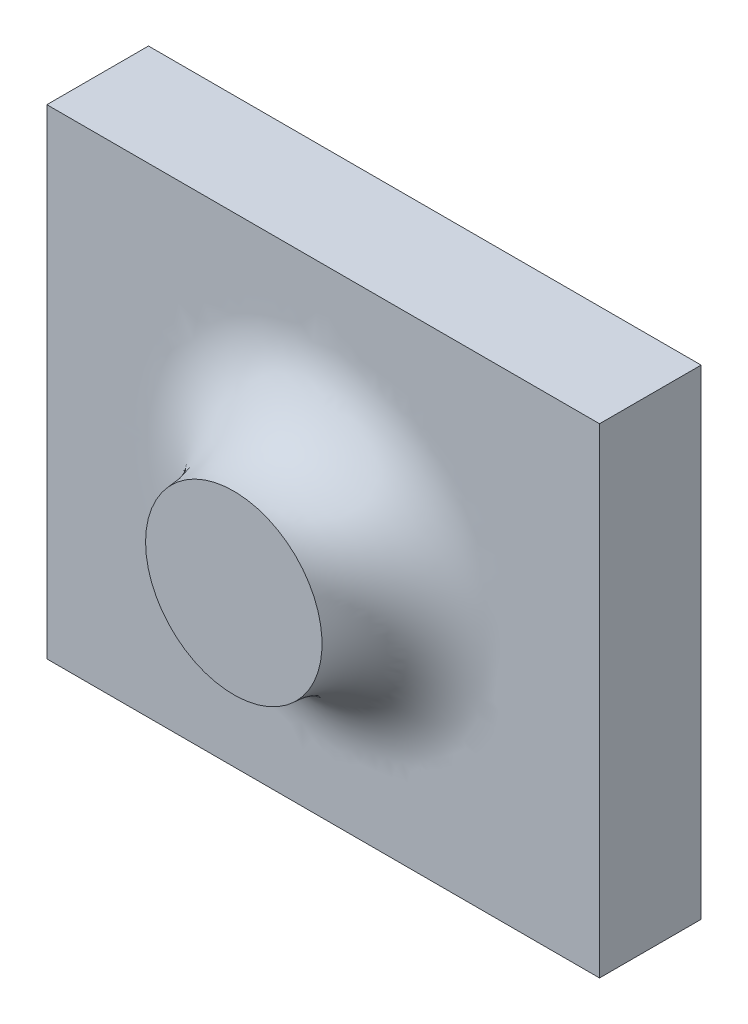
from build123d import *

# Parameters (mm, degrees)
SKIZZE1_W               = 130.20945863
SKIZZE1_H               = 113.09270106
LINEAR_AUSTRAGEN1_DEPTH = 45


with BuildPart() as part:
    # Skizze1 → Linear austragen1 (new body)
    with BuildSketch(Plane.XY):
        Rectangle(SKIZZE1_W, SKIZZE1_H)
    extrude(amount=-LINEAR_AUSTRAGEN1_DEPTH)

    # Skizze2 → Schnitt-Rotation1 (revolve, cut)
    with BuildSketch(Plane(origin=(0, 0, 0), x_dir=(1, 0, 0), z_dir=(0, 1, 0))):
        with BuildLine():
            Line((-127.959669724, 21.063539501), (-127.959669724, 0))
            Line((-127.959669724, 0), (-20.787669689, 0))
            add(Edge.make_bspline(
                [(-20.787669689, 0), (-20.787669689, 11.815073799), (-28.912831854, 20.392818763), (-40.710569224, 21.032632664), (-40.837167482, 21.03949833), (-41.090487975, 21.050943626), (-41.470856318, 21.063539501), (-41.7244249, 21.063539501), (-41.85120919, 21.063539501), (-41.977195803, 21.063539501), (-42.229169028, 21.063539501), (-42.607128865, 21.063539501), (-42.85910209, 21.063539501), (-42.985088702, 21.063539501), (-71.309949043, 21.063539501), (-99.634809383, 21.063539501), (-127.959669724, 21.063539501)],
                knots=[0, 0, 0, 0, 0.249273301, 0.249273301, 0.249273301, 0.252545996, 0.255818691, 0.259091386, 0.259091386, 0.259091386, 0.26234349, 0.265595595, 0.268847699, 0.268847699, 0.268847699, 1, 1, 1, 1], degree=3, weights=[1, 0.817333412, 0.817333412, 1, 1, 1, 1, 1, 1, 1, 1, 1, 1, 1, 1, 1, 1]))
        make_face()
    revolve(axis=Axis((0, 0, -21.063539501), (0, 0, 1)), mode=Mode.SUBTRACT)


solid = part.part
